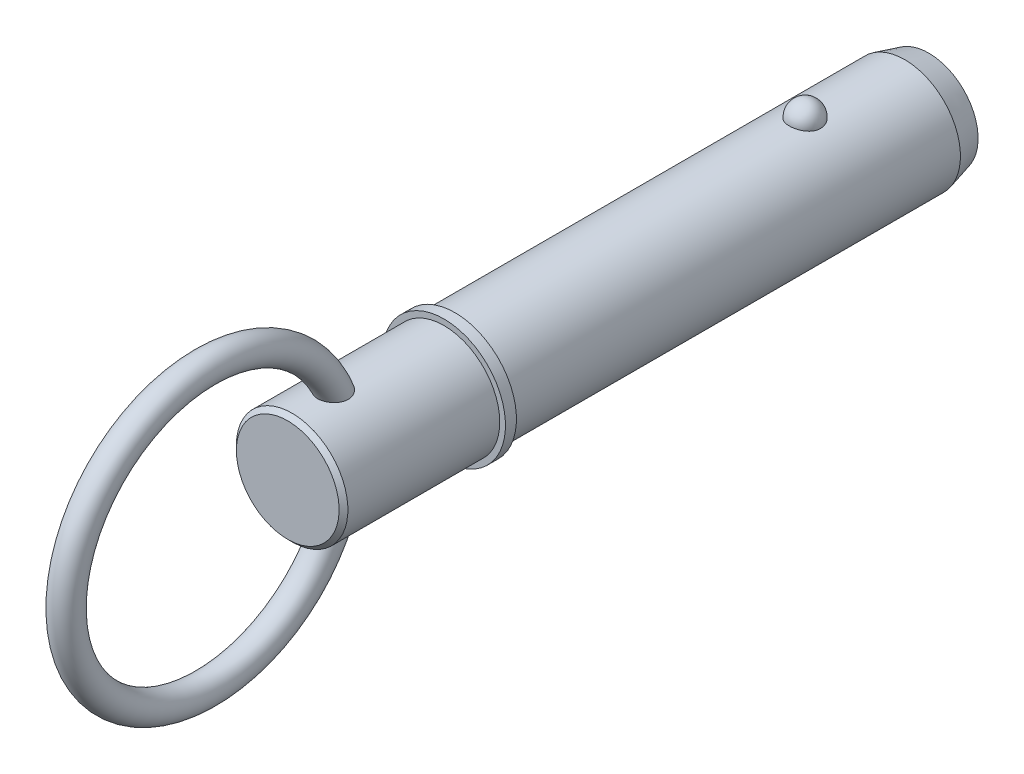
from build123d import *

# Parameters (mm, degrees)
SKETCH2_R           = 12.7
BOSS_EXTRUDE1_DEPTH = 76.2
BOSS_EXTRUDE2_START = 31.75
SKETCH3_R           = 12.7
BOSS_EXTRUDE2_DEPTH = 31.75
CHAMFER1_SIZE       = 5.5
CHAMFER1_SIZE2      = 1.473720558
SKETCH20_W          = 2.5
SKETCH20_H          = 14
SKETCH21_R          = 12.7
BOSS_EXTRUDE3_DEPTH = 38.1
CHAMFER2_SIZE       = 1
SKETCH24_R          = 3.25


with BuildPart() as part:
    # Sketch2 → Boss-Extrude1 (new body)
    with BuildSketch(Plane.XY):
        with Locations(Location((0, 0, 0), (0, 0, 180))):
            Circle(SKETCH2_R)
    extrude(amount=BOSS_EXTRUDE1_DEPTH)

    # Sketch3 → Boss-Extrude2 (add)
    with BuildSketch(Plane(origin=(0, 0, 0), x_dir=(-1, 0, 0), z_dir=(0, 0, -1)).offset(BOSS_EXTRUDE2_START)):
        Circle(SKETCH3_R)
    extrude(amount=-BOSS_EXTRUDE2_DEPTH)

    # Chamfer1
    chamfer1_edges = [part.edges().sort_by_distance(p)[0] for p in [
        (12.7, 0, -31.75),
    ]]
    chamfer1_side = [part.faces().sort_by_distance(p)[0] for p in [
        (12.7, 0, 22.225),
    ]]
    chamfer(chamfer1_edges, length=CHAMFER1_SIZE, length2=CHAMFER1_SIZE2, reference=chamfer1_side[0])

    # Sketch18 → Revolve1 (revolve)
    with BuildSketch(Plane(origin=(0, 0, 0), x_dir=(0, 0, -1), z_dir=(1, 0, 0))):
        with BuildLine():
            Line((3.56, 16.26), (3.56, 9.14))
            ThreePointArc((3.56, 9.14), (0, 12.7), (3.56, 16.26))
        make_face()
    revolve(axis=Axis((0, 16.26, -3.56), (0, -1, 0)))

    # Sketch20 → Revolve2 (revolve)
    with BuildSketch(Plane(origin=(0, 0, 0), x_dir=(0, 0, -1), z_dir=(1, 0, 0)), mode=Mode.PRIVATE) as revolve2_sk:
        with Locations((-77.45, 7)):
            Rectangle(SKETCH20_W, SKETCH20_H)
    revolve(revolve2_sk.sketch.rotate(Axis((0, 0, 33.728787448), (0, 0, 1)), 90), axis=Axis((0, 0, 33.728787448), (0, 0, 1)))

    # Sketch21 → Boss-Extrude3 (add)
    with BuildSketch(Plane(origin=(0, 0, 76.2), x_dir=(-1, 0, 0), z_dir=(0, 0, -1))):
        Circle(SKETCH21_R)
    extrude(amount=-BOSS_EXTRUDE3_DEPTH)

    # Chamfer2
    chamfer2_edges = [part.edges().sort_by_distance(p)[0] for p in [
        (12.7, 0, 114.3),
    ]]
    chamfer(chamfer2_edges, length=CHAMFER2_SIZE)

    # Sweep1: sweep along a path in Sketch23
    with BuildLine(Plane(origin=(0, 0, 0), x_dir=(0, 0, -1), z_dir=(1, 0, 0))) as sweep1_path:
        CenterArc((-133.05, 0), 31.75, 0, 360)
    # Sketch24 → Sweep1 (sweep)
    with BuildSketch(Plane(origin=(0, 0, 0), x_dir=(1, 0, 0), z_dir=(0, 1, 0))):
        with Locations((0, -101.3)):
            Circle(SKETCH24_R)
    sweep(path=sweep1_path.line)


solid = part.part
